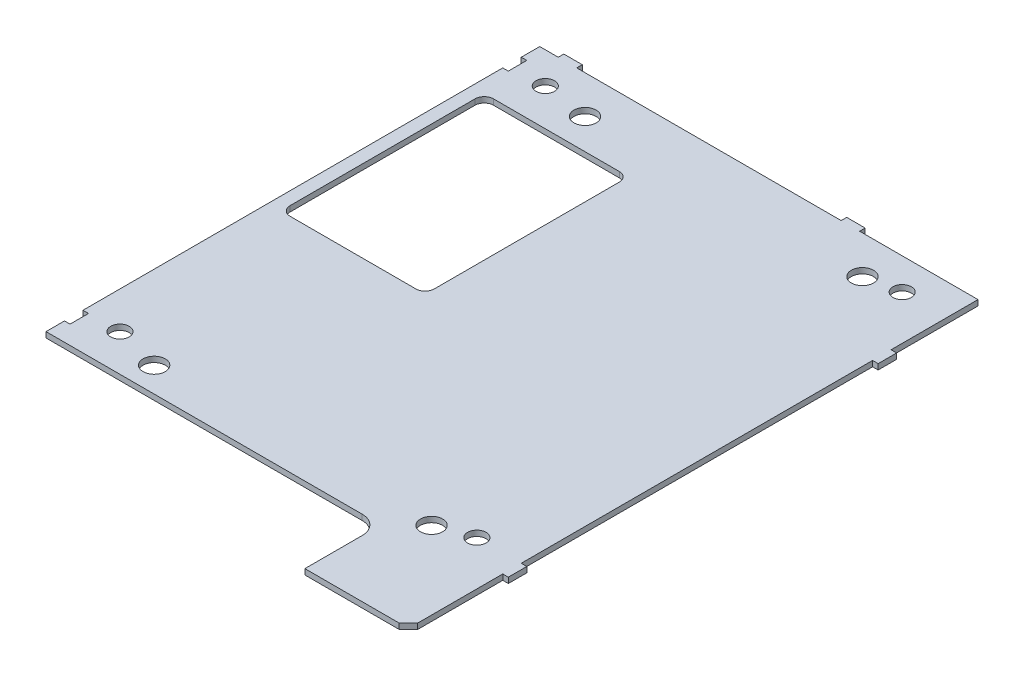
from build123d import *

# Parameters (mm, degrees)
SKETCH_1_W                  = 530
SKETCH_1_H                  = 307
EXTRUDE_1_DEPTH             = 3
SKETCH_3_W                  = 102
SKETCH_3_H                  = 200
CUT_EXTRUDE_2_DEPTH         = 613.50142857
FILLET_2_R                  = 5
SKETCH_4_W                  = 27.5
SKETCH_4_H                  = 307
CUT_EXTRUDE_3_DEPTH         = 613.50142857
SKETCH_7_W                  = 170
SKETCH_7_H                  = 307
EXTRUDE_2_DEPTH             = 3
SKETCH_8_W                  = 170
SKETCH_8_H                  = 147
CUT_EXTRUDE_4_DEPTH         = 765.367712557
SKETCH_11_W                 = 47.5
SKETCH_11_H                 = 70
SKETCH_11_H_2               = 37
EXTRUDE_3_DEPTH             = 3
HOLE_WIZARD_10_0_10_1_D     = 10
SKETCH_16_W                 = 44
SKETCH_16_H                 = 200
EXTRUDE_5_DEPTH             = 3
FILLET_4_R                  = 5
SKETCH_18_W                 = 7
SKETCH_18_H                 = 160
EXTRUDE_7_DEPTH             = 3
SKETCH_19_W                 = 177
SKETCH_19_H                 = 160
CUT_EXTRUDE_5_DEPTH         = 771.78336775
SKETCH_21_W                 = 20
SKETCH_21_H                 = 307
EXTRUDE_8_DEPTH             = 3
SKETCH_20_R                 = 6
CUT_EXTRUDE_6_DEPTH         = 630.887291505
SKETCH_22_W                 = 78
SKETCH_22_H                 = 90
EXTRUDE_9_DEPTH             = 3
FILLET_5_R                  = 5
HOLE_WIZARD_12_0_12_2_D     = 12
SKETCH_23_W                 = 40
SKETCH_23_H                 = 10
CUT_EXTRUDE_7_DEPTH         = 630.887291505
SKETCH_27_W                 = 3
SKETCH_27_H                 = 10
CUT_EXTRUDE_10_DEPTH        = 630.887291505
SKETCH_29_W                 = 426
SKETCH_29_H                 = 8
EXTRUDE_10_DEPTH            = 3
SKETCH_30_W                 = 10
SKETCH_30_H                 = 3
CUT_EXTRUDE_12_DEPTH        = 630.887291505
SKETCH_31_W                 = 144
SKETCH_31_H                 = 30
CUT_EXTRUDE_13_DEPTH        = 630.887291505
SKETCH_32_W                 = 14.653295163
SKETCH_32_H                 = 19.387436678
EXTRUDE_11_DEPTH            = 3
SKETCH_33_W                 = 3
SKETCH_33_H                 = 10
CUT_EXTRUDE_14_DEPTH        = 630.887291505
CUT_EXTRUDE_16_DEPTH        = 630.887291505
SKETCH_36_W                 = 14.940084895
SKETCH_36_H                 = 27.122000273
EXTRUDE_12_DEPTH            = 3
SKETCH_37_W                 = 296
SKETCH_37_H                 = 315
CUT_EXTRUDE_17_DEPTH        = 630.887291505
SKETCH_38_W                 = 130
SKETCH_38_H                 = 38
CUT_EXTRUDE_18_DEPTH        = 399.464553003
SKETCH_39_W                 = 274
SKETCH_39_H                 = 10
CUT_EXTRUDE_19_DEPTH        = 399.464553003
SKETCH_41_W                 = 10
SKETCH_41_H                 = 3
EXTRUDE_13_DEPTH            = 3
SKETCH_42_W                 = 3
SKETCH_42_H                 = 10
EXTRUDE_14_DEPTH            = 3
SKETCH_43_W                 = 56
SKETCH_43_H                 = 41
EXTRUDE_15_DEPTH            = 3
CHAMFER_1_SIZE              = 5
FILLET_6_R                  = 10
SKETCH_44_R                 = 5
CUT_EXTRUDE_21_DEPTH        = 403.688465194
PATTERN_LINEAR_1_COUNT      = 2
PATTERN_LINEAR_1_PITCH      = 193
PATTERN_LINEAR_1_COUNT_DIR2 = 2
PATTERN_LINEAR_1_PITCH_DIR2 = 230
SKETCH_45_W                 = 37
SKETCH_45_H                 = 267
CUT_EXTRUDE_22_DEPTH        = 403.688465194


with BuildPart() as part:
    # Sketch 1 → Extrude 1 (new body)
    with BuildSketch(Plane(origin=(0, 0, 0), x_dir=(1, 0, 0), z_dir=(0, 1, 0))):
        with Locations((265, 153.5)):
            Rectangle(SKETCH_1_W, SKETCH_1_H)
    extrude(amount=EXTRUDE_1_DEPTH)

    # Sketch 3 → Cut-Extrude 2 (cut, through all)
    with BuildSketch(Plane(origin=(0, 3, 0), x_dir=(1, 0, 0), z_dir=(0, 1, 0))):
        with Locations((51, 170)):
            Rectangle(SKETCH_3_W, SKETCH_3_H)
    extrude(amount=-CUT_EXTRUDE_2_DEPTH, mode=Mode.SUBTRACT)

    # Fillet 2
    fillet_2_edges = [part.edges().sort_by_distance(p)[0] for p in [
        (102, 1.5, -270),
        (102, 1.5, -70),
    ]]
    fillet(fillet_2_edges, radius=FILLET_2_R)

    # Sketch 4 → Cut-Extrude 3 (cut, through all)
    with BuildSketch(Plane(origin=(0, 3, 0), x_dir=(1, 0, 0), z_dir=(0, 1, 0))):
        with Locations((13.75, 153.5)):
            Rectangle(SKETCH_4_W, SKETCH_4_H)
    extrude(amount=-CUT_EXTRUDE_3_DEPTH, mode=Mode.SUBTRACT)

    # Sketch 7 → Extrude 2 (add)
    with BuildSketch(Plane(origin=(0, 3, 0), x_dir=(1, 0, 0), z_dir=(0, 1, 0))):
        with Locations((615, 153.5)):
            Rectangle(SKETCH_7_W, SKETCH_7_H)
    extrude(amount=-EXTRUDE_2_DEPTH)

    # Sketch 8 → Cut-Extrude 4 (cut, through all)
    with BuildSketch(Plane(origin=(0, 3, 0), x_dir=(1, 0, 0), z_dir=(0, 1, 0))):
        with Locations((615, 233.5)):
            Rectangle(SKETCH_8_W, SKETCH_8_H)
    extrude(amount=-CUT_EXTRUDE_4_DEPTH, mode=Mode.SUBTRACT)

    # Sketch 11 → Extrude 3 (add)
    with BuildSketch(Plane.XZ):
        with Locations((3.75, -35)):
            Rectangle(SKETCH_11_W, SKETCH_11_H)
        with Locations((3.75, -288.5)):
            Rectangle(SKETCH_11_W, SKETCH_11_H_2)
    extrude(amount=-EXTRUDE_3_DEPTH)

    # Hole Wizard 10.0 _10_1 (through all)
    with Locations(Plane(origin=(0, 3, 0), x_dir=(1, 0, 0), z_dir=(0, 1, 0))):
        with Locations((547.5, 152.5), (692.5, 152.5), (692.5, 7.5), (547.5, 7.5)):
            Hole(HOLE_WIZARD_10_0_10_1_D / 2)

    # Sketch 16 → Extrude 5 (add)
    with BuildSketch(Plane.XZ):
        with Locations((2, -170)):
            Rectangle(SKETCH_16_W, SKETCH_16_H)
    extrude(amount=-EXTRUDE_5_DEPTH)

    # Fillet 4
    fillet_4_edges = [part.edges().sort_by_distance(p)[0] for p in [
        (24, 1.5, -270),
        (24, 1.5, -70),
    ]]
    fillet(fillet_4_edges, radius=FILLET_4_R)

    # Sketch 18 → Extrude 7 (add)
    with BuildSketch(Plane(origin=(0, 3, 0), x_dir=(1, 0, 0), z_dir=(0, 1, 0))):
        with Locations((703.5, 80)):
            Rectangle(SKETCH_18_W, SKETCH_18_H)
    extrude(amount=-EXTRUDE_7_DEPTH)

    # Sketch 19 → Cut-Extrude 5 (cut, through all)
    with BuildSketch(Plane(origin=(0, 3, 0), x_dir=(1, 0, 0), z_dir=(0, 1, 0))):
        with Locations((618.5, 80)):
            Rectangle(SKETCH_19_W, SKETCH_19_H)
    extrude(amount=-CUT_EXTRUDE_5_DEPTH, mode=Mode.SUBTRACT)

    # Sketch 21 → Extrude 8 (add)
    with BuildSketch(Plane(origin=(0, 3, 0), x_dir=(1, 0, 0), z_dir=(0, 1, 0))):
        with Locations((540, 153.5)):
            Rectangle(SKETCH_21_W, SKETCH_21_H)
    extrude(amount=-EXTRUDE_8_DEPTH)

    # Sketch 20 → Cut-Extrude 6 (cut, through all)
    with BuildSketch(Plane(origin=(0, 3, 0), x_dir=(1, 0, 0), z_dir=(0, 1, 0))):
        with Locations(Location((530.5, 65, 0), (0, 0, 270))):
            Circle(SKETCH_20_R)
        with Locations(Location((400.5, 65, 0), (0, 0, 270))):
            Circle(SKETCH_20_R)
        with Locations(Location((400.5, 255, 0), (0, 0, 270))):
            Circle(SKETCH_20_R)
        with Locations(Location((530.5, 255, 0), (0, 0, 270))):
            Circle(SKETCH_20_R)
    extrude(amount=-CUT_EXTRUDE_6_DEPTH, mode=Mode.SUBTRACT)

    # Sketch 22 → Extrude 9 (add)
    with BuildSketch(Plane(origin=(0, 3, 0), x_dir=(1, 0, 0), z_dir=(0, 1, 0))):
        with Locations((63, 115)):
            Rectangle(SKETCH_22_W, SKETCH_22_H)
    extrude(amount=-EXTRUDE_9_DEPTH)

    # Fillet 5
    fillet_5_edges = [part.edges().sort_by_distance(p)[0] for p in [
        (102, 1.5, -160),
        (24, 1.5, -160),
    ]]
    fillet(fillet_5_edges, radius=FILLET_5_R)

    # Hole Wizard 12.0 _12_2 (through all)
    with Locations(Plane(origin=(0, 0, 0), x_dir=(-1, 0, 0), z_dir=(0, -1, 0))):
        with Locations((-62, 53.5), (-212, 53.5), (-212, 286.5), (-62, 286.5)):
            Hole(HOLE_WIZARD_12_0_12_2_D / 2)

    # Sketch 23 → Cut-Extrude 7 (cut, through all)
    with BuildSketch(Plane.XZ):
        with Locations((0, -55)):
            Rectangle(SKETCH_23_W, SKETCH_23_H)
        with Locations((0, -292)):
            Rectangle(SKETCH_23_W, SKETCH_23_H)
    extrude(amount=-CUT_EXTRUDE_7_DEPTH, mode=Mode.SUBTRACT)

    # Sketch 27 → Cut-Extrude 10 (cut, through all)
    with BuildSketch(Plane.XZ):
        with Locations((548.5, -289)):
            Rectangle(SKETCH_27_W, SKETCH_27_H)
        with Locations((548.5, -10)):
            Rectangle(SKETCH_27_W, SKETCH_27_H)
    extrude(amount=-CUT_EXTRUDE_10_DEPTH, mode=Mode.SUBTRACT)

    # Sketch 29 → Extrude 10 (add)
    with BuildSketch(Plane.XZ):
        with Locations((337, 4)):
            Rectangle(SKETCH_29_W, SKETCH_29_H)
    extrude(amount=-EXTRUDE_10_DEPTH)

    # Sketch 30 → Cut-Extrude 12 (cut, through all)
    with BuildSketch(Plane.XZ):
        with Locations((532, 6.5)):
            Rectangle(SKETCH_30_W, SKETCH_30_H)
        with Locations((142, 6.5)):
            Rectangle(SKETCH_30_W, SKETCH_30_H)
    extrude(amount=-CUT_EXTRUDE_12_DEPTH, mode=Mode.SUBTRACT)

    # Sketch 31 → Cut-Extrude 13 (cut, through all)
    with BuildSketch(Plane(origin=(0, 3, 0), x_dir=(1, 0, 0), z_dir=(0, 1, 0))):
        with Locations((52, 15)):
            Rectangle(SKETCH_31_W, SKETCH_31_H)
    extrude(amount=-CUT_EXTRUDE_13_DEPTH, mode=Mode.SUBTRACT)

    # Sketch 32 → Extrude 11 (add)
    with BuildSketch(Plane(origin=(0, 3, 0), x_dir=(1, 0, 0), z_dir=(0, 1, 0))):
        with Locations((125.410487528, 48.594218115)):
            Rectangle(SKETCH_32_W, SKETCH_32_H)
    extrude(amount=-EXTRUDE_11_DEPTH)

    # Sketch 33 → Cut-Extrude 14 (cut, through all)
    with BuildSketch(Plane(origin=(0, 3, 0), x_dir=(1, 0, 0), z_dir=(0, 1, 0))):
        with Locations((125.5, 10)):
            Rectangle(SKETCH_33_W, SKETCH_33_H)
    extrude(amount=-CUT_EXTRUDE_14_DEPTH, mode=Mode.SUBTRACT)

    # Sketch 35 → Cut-Extrude 16 (cut, through all)
    with BuildSketch(Plane.XZ):
        with BuildLine():
            Line((252, -4), (252, -16))
            ThreePointArc((252, -16), (250.5, -17.5), (249, -16))
            Line((249, -16), (249, -4))
            ThreePointArc((249, -4), (250.5, -2.5), (252, -4))
        make_face()
    extrude(amount=-CUT_EXTRUDE_16_DEPTH, mode=Mode.SUBTRACT)

    # Sketch 36 → Extrude 12 (add)
    with BuildSketch(Plane.XZ):
        with Locations((250.394567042, -48.475188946)):
            Rectangle(SKETCH_36_W, SKETCH_36_H)
    extrude(amount=-EXTRUDE_12_DEPTH)

    # Sketch 37 → Cut-Extrude 17 (cut, through all)
    with BuildSketch(Plane.XZ):
        with Locations((402, -149.5)):
            Rectangle(SKETCH_37_W, SKETCH_37_H)
    extrude(amount=-CUT_EXTRUDE_17_DEPTH, mode=Mode.SUBTRACT)

    # Sketch 38 → Cut-Extrude 18 (cut, through all)
    with BuildSketch(Plane(origin=(0, 3, 0), x_dir=(1, 0, 0), z_dir=(0, 1, 0))):
        with Locations((189, 11)):
            Rectangle(SKETCH_38_W, SKETCH_38_H)
    extrude(amount=-CUT_EXTRUDE_18_DEPTH, mode=Mode.SUBTRACT)

    # Sketch 39 → Cut-Extrude 19 (cut, through all)
    with BuildSketch(Plane(origin=(0, 3, 0), x_dir=(1, 0, 0), z_dir=(0, 1, 0))):
        with Locations((117, 35)):
            Rectangle(SKETCH_39_W, SKETCH_39_H)
    extrude(amount=-CUT_EXTRUDE_19_DEPTH, mode=Mode.SUBTRACT)

    # Sketch 41 → Extrude 13 (add)
    with BuildSketch(Plane.XZ):
        with Locations((32, -308.5)):
            Rectangle(SKETCH_41_W, SKETCH_41_H)
        with Locations((185, -308.5)):
            Rectangle(SKETCH_41_W, SKETCH_41_H)
    extrude(amount=-EXTRUDE_13_DEPTH)

    # Sketch 42 → Extrude 14 (add)
    with BuildSketch(Plane.XZ):
        with Locations((255.5, -55)):
            Rectangle(SKETCH_42_W, SKETCH_42_H)
        with Locations((255.5, -255)):
            Rectangle(SKETCH_42_W, SKETCH_42_H)
    extrude(amount=-EXTRUDE_14_DEPTH)

    # Sketch 43 → Extrude 15 (add)
    with BuildSketch(Plane(origin=(0, 3, 0), x_dir=(1, 0, 0), z_dir=(0, 1, 0))):
        with Locations((226, 19.5)):
            Rectangle(SKETCH_43_W, SKETCH_43_H)
    extrude(amount=-EXTRUDE_15_DEPTH)

    # Chamfer 1
    chamfer_1_edges = [part.edges().sort_by_distance(p)[0] for p in [
        (254, 1.5, 1),
    ]]
    chamfer(chamfer_1_edges, length=CHAMFER_1_SIZE)

    # Fillet 6
    fillet_6_edges = [part.edges().sort_by_distance(p)[0] for p in [
        (198, 1.5, -40),
    ]]
    fillet(fillet_6_edges, radius=FILLET_6_R)

    # Sketch 44 → Cut-Extrude 21 (cut, through all)
    with BuildSketch(Plane.XZ):
        with Locations(Location((37, -60, 0), (0, 0, 270))):
            Circle(SKETCH_44_R)
    cut_extrude_21 = extrude(amount=-CUT_EXTRUDE_21_DEPTH, mode=Mode.SUBTRACT)

    # Pattern Linear 1: Cut-Extrude 21 2 × 2
    with Locations(*[(i * PATTERN_LINEAR_1_PITCH, 0, -j * PATTERN_LINEAR_1_PITCH_DIR2) for i in range(PATTERN_LINEAR_1_COUNT) for j in range(PATTERN_LINEAR_1_COUNT_DIR2) if (i, j) != (0, 0)]):
        add(cut_extrude_21, mode=Mode.SUBTRACT)

    # Sketch 45 → Cut-Extrude 22 (cut, through all)
    with BuildSketch(Plane(origin=(0, 3, 0), x_dir=(1, 0, 0), z_dir=(0, 1, 0))):
        with Locations((-1.5, 173.5)):
            Rectangle(SKETCH_45_W, SKETCH_45_H)
    extrude(amount=-CUT_EXTRUDE_22_DEPTH, mode=Mode.SUBTRACT)


solid = part.part
